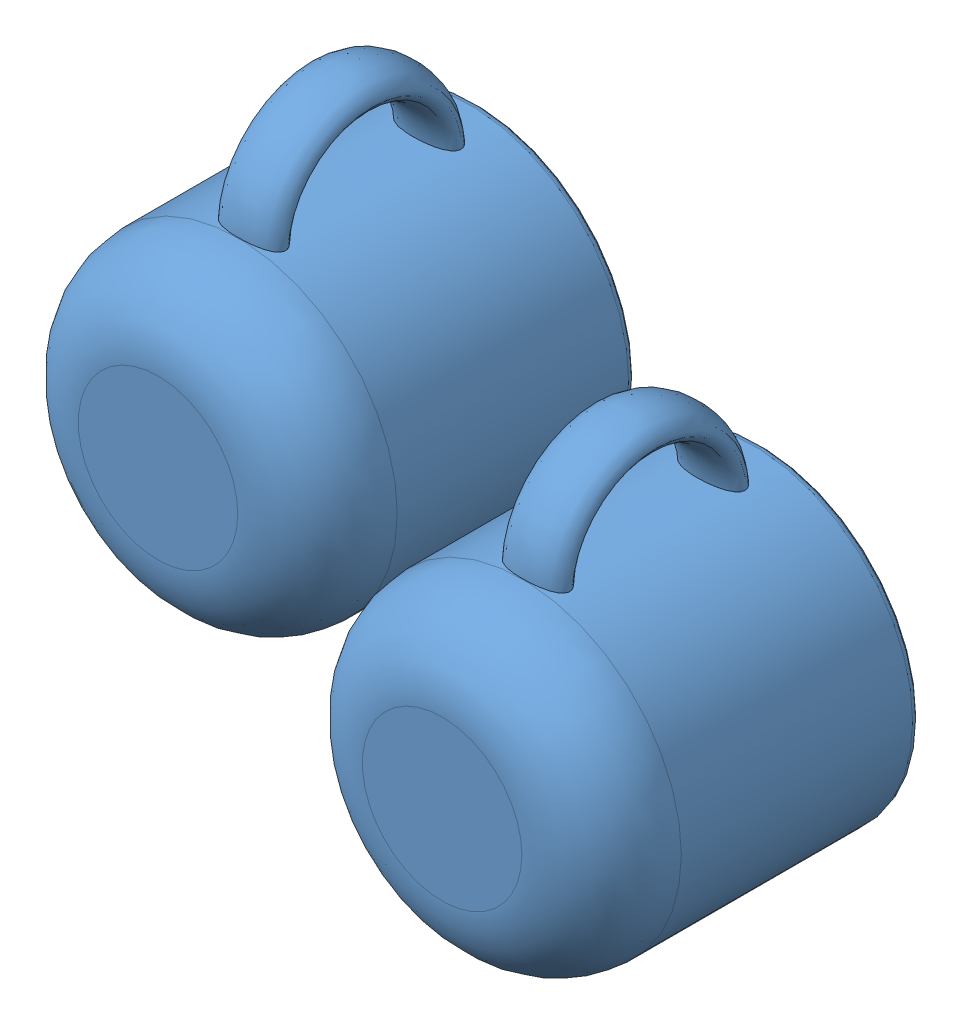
SolidWorks assembly cup2008.sldasm, configuration Default (file format 4100). Lengths in mm.
Overall size (388.77 345.62 210.68).
2 component instances, 1 part files, 0 mates.
Components (placement in the parent):
- cup2008-1: cup2008.sldprt [Default] at (-191.9715 27.7585 -13.6986) size (200 260.2 200)
- cup2008-2: cup2008.sldprt [Default] at (-3.2038 -57.6603 -3.0204) size (200 260.2 200)
